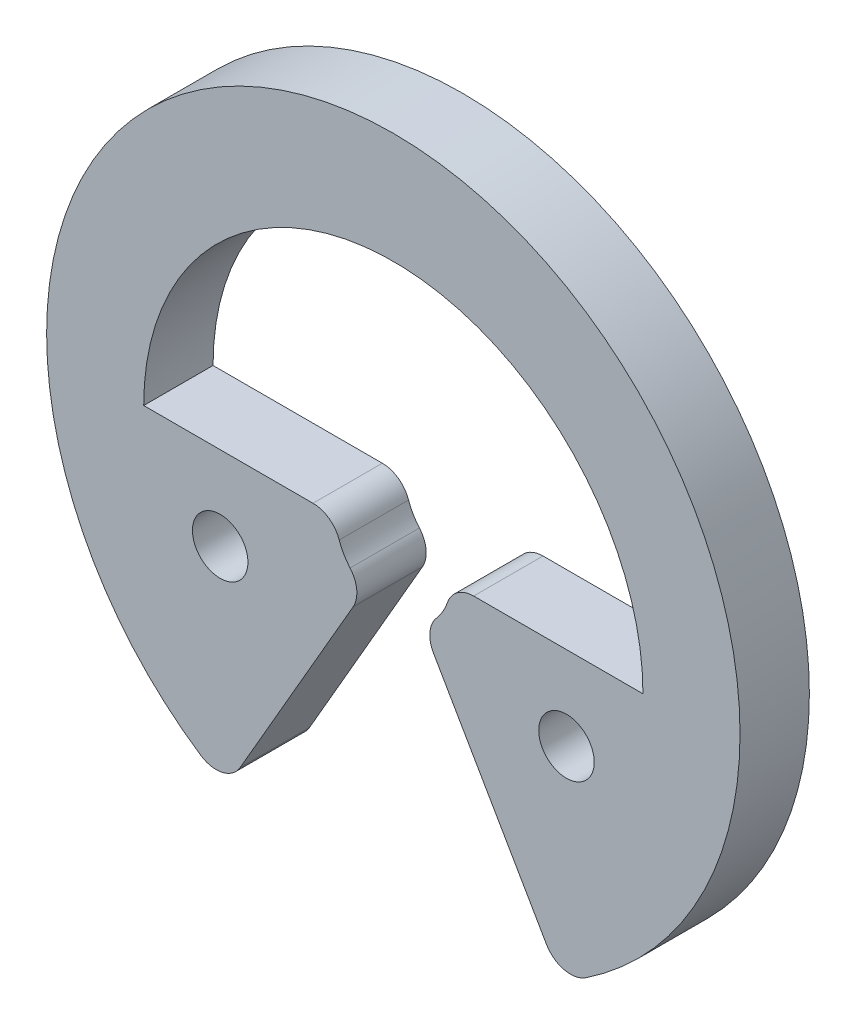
ISO-10303-21;
HEADER;
FILE_DESCRIPTION(('STEP AP214'),'2;1');
FILE_NAME('part.step','',(''),(''),'','','');
FILE_SCHEMA(('AUTOMOTIVE_DESIGN { 1 0 10303 214 1 1 1 1 }'));
ENDSEC;
DATA;
#1=APPLICATION_CONTEXT('core data for automotive mechanical design processes');
#2=APPLICATION_PROTOCOL_DEFINITION('international standard','automotive_design',2000,#1);
#3=PRODUCT_CONTEXT('',#1,'mechanical');
#4=PRODUCT('Part','Part','',(#3));
#5=PRODUCT_RELATED_PRODUCT_CATEGORY('part','',(#4));
#6=PRODUCT_DEFINITION_FORMATION('','',#4);
#7=PRODUCT_DEFINITION_CONTEXT('part definition',#1,'design');
#8=PRODUCT_DEFINITION('design','',#6,#7);
#9=PRODUCT_DEFINITION_SHAPE('','',#8);
#10=(LENGTH_UNIT() NAMED_UNIT(*) SI_UNIT(.MILLI.,.METRE.));
#11=(NAMED_UNIT(*) PLANE_ANGLE_UNIT() SI_UNIT($,.RADIAN.));
#12=(NAMED_UNIT(*) SI_UNIT($,.STERADIAN.) SOLID_ANGLE_UNIT());
#13=UNCERTAINTY_MEASURE_WITH_UNIT(LENGTH_MEASURE(1.E-05),#10,'distance_accuracy_value','');
#14=(GEOMETRIC_REPRESENTATION_CONTEXT(3) GLOBAL_UNCERTAINTY_ASSIGNED_CONTEXT((#13)) GLOBAL_UNIT_ASSIGNED_CONTEXT((#10,
#11,#12)) REPRESENTATION_CONTEXT('',''));
#15=CARTESIAN_POINT('',(0.,0.,0.));
#16=DIRECTION('',(0.,0.,1.));
#17=DIRECTION('',(1.,0.,0.));
#18=AXIS2_PLACEMENT_3D('',#15,#16,#17);
#19=CARTESIAN_POINT('',(0.579347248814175,-0.199999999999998,0.5));
#20=DIRECTION('',(0.,0.,-1.));
#21=DIRECTION('',(-1.,0.,0.));
#22=AXIS2_PLACEMENT_3D('',#19,#20,#21);
#23=PLANE('',#22);
#24=CARTESIAN_POINT('',(-1.24848102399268,-0.603586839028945,0.5));
#25=DIRECTION('',(0.,0.,1.));
#26=DIRECTION('',(1.,0.,0.));
#27=AXIS2_PLACEMENT_3D('',#24,#25,#26);
#28=CIRCLE('',#27,0.2);
#29=CARTESIAN_POINT('',(-1.04848102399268,-0.603586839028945,0.5));
#30=VERTEX_POINT('',#29);
#31=EDGE_CURVE('E152',#30,#30,#28,.T.);
#32=ORIENTED_EDGE('',*,*,#31,.F.);
#33=EDGE_LOOP('',(#32));
#34=FACE_BOUND('',#33,.T.);
#35=CARTESIAN_POINT('',(0.579347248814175,-0.199999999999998,0.5));
#36=DIRECTION('',(0.,0.,1.));
#37=DIRECTION('',(-1.,0.,0.));
#38=AXIS2_PLACEMENT_3D('',#35,#36,#37);
#39=CIRCLE('',#38,0.2);
#40=CARTESIAN_POINT('',(0.579347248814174,0.,0.5));
#41=VERTEX_POINT('',#40);
#42=CARTESIAN_POINT('',(0.39029529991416,-0.134736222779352,0.5));
#43=VERTEX_POINT('',#42);
#44=EDGE_CURVE('E182',#41,#43,#39,.T.);
#45=ORIENTED_EDGE('',*,*,#44,.T.);
#46=CARTESIAN_POINT('',(0.,0.,0.5));
#47=DIRECTION('',(0.,0.,-1.));
#48=DIRECTION('',(1.,0.,0.));
#49=AXIS2_PLACEMENT_3D('',#46,#47,#48);
#50=CIRCLE('',#49,0.412897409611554);
#51=CARTESIAN_POINT('',(0.311832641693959,-0.270637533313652,0.5));
#52=VERTEX_POINT('',#51);
#53=EDGE_CURVE('E147',#43,#52,#50,.T.);
#54=ORIENTED_EDGE('',*,*,#53,.T.);
#55=CARTESIAN_POINT('',(0.462878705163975,-0.401729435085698,0.5));
#56=DIRECTION('',(0.,0.,1.));
#57=DIRECTION('',(-1.,0.,0.));
#58=AXIS2_PLACEMENT_3D('',#55,#56,#57);
#59=CIRCLE('',#58,0.2);
#60=CARTESIAN_POINT('',(0.289673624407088,-0.501729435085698,0.5));
#61=VERTEX_POINT('',#60);
#62=EDGE_CURVE('E185',#52,#61,#59,.T.);
#63=ORIENTED_EDGE('',*,*,#62,.T.);
#64=DIRECTION('',(0.500000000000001,-0.866025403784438,0.));
#65=VECTOR('',#64,1.);
#66=CARTESIAN_POINT('',(1.10425047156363,-1.91261792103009,0.5));
#67=LINE('',#66,#65);
#68=CARTESIAN_POINT('',(1.10425047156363,-1.91261792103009,0.5));
#69=VERTEX_POINT('',#68);
#70=EDGE_CURVE('E187',#61,#69,#67,.T.);
#71=ORIENTED_EDGE('',*,*,#70,.T.);
#72=CARTESIAN_POINT('',(1.27745555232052,-1.81261792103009,0.5));
#73=DIRECTION('',(0.,0.,1.));
#74=DIRECTION('',(-1.,0.,0.));
#75=AXIS2_PLACEMENT_3D('',#72,#73,#74);
#76=CIRCLE('',#75,0.2);
#77=CARTESIAN_POINT('',(1.38853864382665,-1.9789325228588,0.5));
#78=VERTEX_POINT('',#77);
#79=EDGE_CURVE('E189',#69,#78,#76,.T.);
#80=ORIENTED_EDGE('',*,*,#79,.T.);
#81=CARTESIAN_POINT('',(0.,0.1,0.5));
#82=DIRECTION('',(0.,0.,1.));
#83=DIRECTION('',(1.,0.,0.));
#84=AXIS2_PLACEMENT_3D('',#81,#82,#83);
#85=CIRCLE('',#84,2.5);
#86=CARTESIAN_POINT('',(-1.38853864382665,-1.9789325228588,0.5));
#87=VERTEX_POINT('',#86);
#88=EDGE_CURVE('E191',#78,#87,#85,.T.);
#89=ORIENTED_EDGE('',*,*,#88,.T.);
#90=CARTESIAN_POINT('',(-1.27745555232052,-1.81261792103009,0.5));
#91=DIRECTION('',(0.,0.,1.));
#92=DIRECTION('',(1.,0.,0.));
#93=AXIS2_PLACEMENT_3D('',#90,#91,#92);
#94=CIRCLE('',#93,0.2);
#95=CARTESIAN_POINT('',(-1.10425047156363,-1.91261792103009,0.5));
#96=VERTEX_POINT('',#95);
#97=EDGE_CURVE('E193',#87,#96,#94,.T.);
#98=ORIENTED_EDGE('',*,*,#97,.T.);
#99=DIRECTION('',(0.500000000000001,0.866025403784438,0.));
#100=VECTOR('',#99,1.);
#101=CARTESIAN_POINT('',(-1.10425047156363,-1.91261792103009,0.5));
#102=LINE('',#101,#100);
#103=CARTESIAN_POINT('',(-0.289673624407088,-0.501729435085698,0.5));
#104=VERTEX_POINT('',#103);
#105=EDGE_CURVE('E195',#96,#104,#102,.T.);
#106=ORIENTED_EDGE('',*,*,#105,.T.);
#107=CARTESIAN_POINT('',(-0.462878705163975,-0.401729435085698,0.5));
#108=DIRECTION('',(0.,0.,1.));
#109=DIRECTION('',(1.,0.,0.));
#110=AXIS2_PLACEMENT_3D('',#107,#108,#109);
#111=CIRCLE('',#110,0.2);
#112=CARTESIAN_POINT('',(-0.311832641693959,-0.270637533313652,0.5));
#113=VERTEX_POINT('',#112);
#114=EDGE_CURVE('E197',#104,#113,#111,.T.);
#115=ORIENTED_EDGE('',*,*,#114,.T.);
#116=CARTESIAN_POINT('',(0.,0.,0.5));
#117=DIRECTION('',(0.,0.,-1.));
#118=DIRECTION('',(1.,0.,0.));
#119=AXIS2_PLACEMENT_3D('',#116,#117,#118);
#120=CIRCLE('',#119,0.412897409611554);
#121=CARTESIAN_POINT('',(-0.39029529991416,-0.134736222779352,0.5));
#122=VERTEX_POINT('',#121);
#123=EDGE_CURVE('E199',#113,#122,#120,.T.);
#124=ORIENTED_EDGE('',*,*,#123,.T.);
#125=CARTESIAN_POINT('',(-0.579347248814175,-0.199999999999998,0.5));
#126=DIRECTION('',(0.,0.,1.));
#127=DIRECTION('',(-1.,0.,0.));
#128=AXIS2_PLACEMENT_3D('',#125,#126,#127);
#129=CIRCLE('',#128,0.2);
#130=CARTESIAN_POINT('',(-0.579347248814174,0.,0.5));
#131=VERTEX_POINT('',#130);
#132=EDGE_CURVE('E201',#122,#131,#129,.T.);
#133=ORIENTED_EDGE('',*,*,#132,.T.);
#134=DIRECTION('',(-1.,0.,0.));
#135=VECTOR('',#134,1.);
#136=CARTESIAN_POINT('',(-0.579347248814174,0.,0.5));
#137=LINE('',#136,#135);
#138=CARTESIAN_POINT('',(-1.8,0.,0.5));
#139=VERTEX_POINT('',#138);
#140=EDGE_CURVE('E203',#131,#139,#137,.T.);
#141=ORIENTED_EDGE('',*,*,#140,.T.);
#142=CARTESIAN_POINT('',(0.,0.,0.5));
#143=DIRECTION('',(0.,0.,-1.));
#144=DIRECTION('',(1.,0.,0.));
#145=AXIS2_PLACEMENT_3D('',#142,#143,#144);
#146=CIRCLE('',#145,1.8);
#147=CARTESIAN_POINT('',(1.8,0.,0.5));
#148=VERTEX_POINT('',#147);
#149=EDGE_CURVE('E52',#139,#148,#146,.T.);
#150=ORIENTED_EDGE('',*,*,#149,.T.);
#151=DIRECTION('',(-1.,0.,0.));
#152=VECTOR('',#151,1.);
#153=CARTESIAN_POINT('',(0.579347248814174,0.,0.5));
#154=LINE('',#153,#152);
#155=EDGE_CURVE('E47',#148,#41,#154,.T.);
#156=ORIENTED_EDGE('',*,*,#155,.T.);
#157=EDGE_LOOP('',(#45,#54,#63,#71,#80,#89,#98,#106,#115,#124,#133,#141,#150,#156));
#158=FACE_BOUND('',#157,.T.);
#159=CARTESIAN_POINT('',(1.24848102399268,-0.603586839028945,0.5));
#160=DIRECTION('',(0.,0.,1.));
#161=DIRECTION('',(-1.,0.,0.));
#162=AXIS2_PLACEMENT_3D('',#159,#160,#161);
#163=CIRCLE('',#162,0.2);
#164=CARTESIAN_POINT('',(1.04848102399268,-0.603586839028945,0.5));
#165=VERTEX_POINT('',#164);
#166=EDGE_CURVE('E322',#165,#165,#163,.T.);
#167=ORIENTED_EDGE('',*,*,#166,.F.);
#168=EDGE_LOOP('',(#167));
#169=FACE_BOUND('',#168,.T.);
#170=ADVANCED_FACE('F32',(#34,#158,#169),#23,.F.);
#171=CARTESIAN_POINT('',(0.579347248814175,-0.199999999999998,0.));
#172=DIRECTION('',(0.,0.,-1.));
#173=DIRECTION('',(-1.,0.,0.));
#174=AXIS2_PLACEMENT_3D('',#171,#172,#173);
#175=PLANE('',#174);
#176=CARTESIAN_POINT('',(-1.24848102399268,-0.603586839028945,0.));
#177=DIRECTION('',(0.,0.,1.));
#178=DIRECTION('',(1.,0.,0.));
#179=AXIS2_PLACEMENT_3D('',#176,#177,#178);
#180=CIRCLE('',#179,0.2);
#181=CARTESIAN_POINT('',(-1.04848102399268,-0.603586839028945,0.));
#182=VERTEX_POINT('',#181);
#183=EDGE_CURVE('E155',#182,#182,#180,.T.);
#184=ORIENTED_EDGE('',*,*,#183,.T.);
#185=EDGE_LOOP('',(#184));
#186=FACE_BOUND('',#185,.T.);
#187=CARTESIAN_POINT('',(0.579347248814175,-0.199999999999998,0.));
#188=DIRECTION('',(0.,0.,1.));
#189=DIRECTION('',(-1.,0.,0.));
#190=AXIS2_PLACEMENT_3D('',#187,#188,#189);
#191=CIRCLE('',#190,0.2);
#192=CARTESIAN_POINT('',(0.579347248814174,0.,0.));
#193=VERTEX_POINT('',#192);
#194=CARTESIAN_POINT('',(0.39029529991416,-0.134736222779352,0.));
#195=VERTEX_POINT('',#194);
#196=EDGE_CURVE('E138',#193,#195,#191,.T.);
#197=ORIENTED_EDGE('',*,*,#196,.F.);
#198=DIRECTION('',(-1.,0.,0.));
#199=VECTOR('',#198,1.);
#200=CARTESIAN_POINT('',(0.579347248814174,0.,0.));
#201=LINE('',#200,#199);
#202=CARTESIAN_POINT('',(1.8,0.,0.));
#203=VERTEX_POINT('',#202);
#204=EDGE_CURVE('E180',#203,#193,#201,.T.);
#205=ORIENTED_EDGE('',*,*,#204,.F.);
#206=CARTESIAN_POINT('',(0.,0.,0.));
#207=DIRECTION('',(0.,0.,-1.));
#208=DIRECTION('',(1.,0.,0.));
#209=AXIS2_PLACEMENT_3D('',#206,#207,#208);
#210=CIRCLE('',#209,1.8);
#211=CARTESIAN_POINT('',(-1.8,0.,0.));
#212=VERTEX_POINT('',#211);
#213=EDGE_CURVE('E178',#212,#203,#210,.T.);
#214=ORIENTED_EDGE('',*,*,#213,.F.);
#215=DIRECTION('',(-1.,0.,0.));
#216=VECTOR('',#215,1.);
#217=CARTESIAN_POINT('',(-0.579347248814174,0.,0.));
#218=LINE('',#217,#216);
#219=CARTESIAN_POINT('',(-0.579347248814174,0.,0.));
#220=VERTEX_POINT('',#219);
#221=EDGE_CURVE('E176',#220,#212,#218,.T.);
#222=ORIENTED_EDGE('',*,*,#221,.F.);
#223=CARTESIAN_POINT('',(-0.579347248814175,-0.199999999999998,0.));
#224=DIRECTION('',(0.,0.,1.));
#225=DIRECTION('',(-1.,0.,0.));
#226=AXIS2_PLACEMENT_3D('',#223,#224,#225);
#227=CIRCLE('',#226,0.2);
#228=CARTESIAN_POINT('',(-0.39029529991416,-0.134736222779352,0.));
#229=VERTEX_POINT('',#228);
#230=EDGE_CURVE('E174',#229,#220,#227,.T.);
#231=ORIENTED_EDGE('',*,*,#230,.F.);
#232=CARTESIAN_POINT('',(0.,0.,0.));
#233=DIRECTION('',(0.,0.,-1.));
#234=DIRECTION('',(1.,0.,0.));
#235=AXIS2_PLACEMENT_3D('',#232,#233,#234);
#236=CIRCLE('',#235,0.412897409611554);
#237=CARTESIAN_POINT('',(-0.311832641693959,-0.270637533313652,0.));
#238=VERTEX_POINT('',#237);
#239=EDGE_CURVE('E172',#238,#229,#236,.T.);
#240=ORIENTED_EDGE('',*,*,#239,.F.);
#241=CARTESIAN_POINT('',(-0.462878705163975,-0.401729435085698,0.));
#242=DIRECTION('',(0.,0.,1.));
#243=DIRECTION('',(1.,0.,0.));
#244=AXIS2_PLACEMENT_3D('',#241,#242,#243);
#245=CIRCLE('',#244,0.2);
#246=CARTESIAN_POINT('',(-0.289673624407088,-0.501729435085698,0.));
#247=VERTEX_POINT('',#246);
#248=EDGE_CURVE('E170',#247,#238,#245,.T.);
#249=ORIENTED_EDGE('',*,*,#248,.F.);
#250=DIRECTION('',(0.500000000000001,0.866025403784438,0.));
#251=VECTOR('',#250,1.);
#252=CARTESIAN_POINT('',(-1.10425047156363,-1.91261792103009,0.));
#253=LINE('',#252,#251);
#254=CARTESIAN_POINT('',(-1.10425047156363,-1.91261792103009,0.));
#255=VERTEX_POINT('',#254);
#256=EDGE_CURVE('E168',#255,#247,#253,.T.);
#257=ORIENTED_EDGE('',*,*,#256,.F.);
#258=CARTESIAN_POINT('',(-1.27745555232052,-1.81261792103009,0.));
#259=DIRECTION('',(0.,0.,1.));
#260=DIRECTION('',(1.,0.,0.));
#261=AXIS2_PLACEMENT_3D('',#258,#259,#260);
#262=CIRCLE('',#261,0.2);
#263=CARTESIAN_POINT('',(-1.38853864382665,-1.9789325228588,0.));
#264=VERTEX_POINT('',#263);
#265=EDGE_CURVE('E166',#264,#255,#262,.T.);
#266=ORIENTED_EDGE('',*,*,#265,.F.);
#267=CARTESIAN_POINT('',(0.,0.1,0.));
#268=DIRECTION('',(0.,0.,1.));
#269=DIRECTION('',(1.,0.,0.));
#270=AXIS2_PLACEMENT_3D('',#267,#268,#269);
#271=CIRCLE('',#270,2.5);
#272=CARTESIAN_POINT('',(1.38853864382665,-1.9789325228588,0.));
#273=VERTEX_POINT('',#272);
#274=EDGE_CURVE('E164',#273,#264,#271,.T.);
#275=ORIENTED_EDGE('',*,*,#274,.F.);
#276=CARTESIAN_POINT('',(1.27745555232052,-1.81261792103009,0.));
#277=DIRECTION('',(0.,0.,1.));
#278=DIRECTION('',(-1.,0.,0.));
#279=AXIS2_PLACEMENT_3D('',#276,#277,#278);
#280=CIRCLE('',#279,0.2);
#281=CARTESIAN_POINT('',(1.10425047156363,-1.91261792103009,0.));
#282=VERTEX_POINT('',#281);
#283=EDGE_CURVE('E162',#282,#273,#280,.T.);
#284=ORIENTED_EDGE('',*,*,#283,.F.);
#285=DIRECTION('',(0.500000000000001,-0.866025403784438,0.));
#286=VECTOR('',#285,1.);
#287=CARTESIAN_POINT('',(1.10425047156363,-1.91261792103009,0.));
#288=LINE('',#287,#286);
#289=CARTESIAN_POINT('',(0.289673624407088,-0.501729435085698,0.));
#290=VERTEX_POINT('',#289);
#291=EDGE_CURVE('E160',#290,#282,#288,.T.);
#292=ORIENTED_EDGE('',*,*,#291,.F.);
#293=CARTESIAN_POINT('',(0.462878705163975,-0.401729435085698,0.));
#294=DIRECTION('',(0.,0.,1.));
#295=DIRECTION('',(-1.,0.,0.));
#296=AXIS2_PLACEMENT_3D('',#293,#294,#295);
#297=CIRCLE('',#296,0.2);
#298=CARTESIAN_POINT('',(0.311832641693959,-0.270637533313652,0.));
#299=VERTEX_POINT('',#298);
#300=EDGE_CURVE('E140',#299,#290,#297,.T.);
#301=ORIENTED_EDGE('',*,*,#300,.F.);
#302=CARTESIAN_POINT('',(0.,0.,0.));
#303=DIRECTION('',(0.,0.,-1.));
#304=DIRECTION('',(1.,0.,0.));
#305=AXIS2_PLACEMENT_3D('',#302,#303,#304);
#306=CIRCLE('',#305,0.412897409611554);
#307=EDGE_CURVE('E133',#195,#299,#306,.T.);
#308=ORIENTED_EDGE('',*,*,#307,.F.);
#309=EDGE_LOOP('',(#197,#205,#214,#222,#231,#240,#249,#257,#266,#275,#284,#292,#301,#308));
#310=FACE_BOUND('',#309,.T.);
#311=CARTESIAN_POINT('',(1.24848102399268,-0.603586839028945,0.));
#312=DIRECTION('',(0.,0.,1.));
#313=DIRECTION('',(-1.,0.,0.));
#314=AXIS2_PLACEMENT_3D('',#311,#312,#313);
#315=CIRCLE('',#314,0.2);
#316=CARTESIAN_POINT('',(1.04848102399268,-0.603586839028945,0.));
#317=VERTEX_POINT('',#316);
#318=EDGE_CURVE('E325',#317,#317,#315,.T.);
#319=ORIENTED_EDGE('',*,*,#318,.T.);
#320=EDGE_LOOP('',(#319));
#321=FACE_BOUND('',#320,.T.);
#322=ADVANCED_FACE('F134',(#186,#310,#321),#175,.T.);
#323=CARTESIAN_POINT('',(0.579347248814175,-0.199999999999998,0.5));
#324=DIRECTION('',(0.,0.,-1.));
#325=DIRECTION('',(-1.,0.,0.));
#326=AXIS2_PLACEMENT_3D('',#323,#324,#325);
#327=CYLINDRICAL_SURFACE('',#326,0.2);
#328=ORIENTED_EDGE('',*,*,#196,.T.);
#329=DIRECTION('',(0.,0.,-1.));
#330=VECTOR('',#329,1.);
#331=CARTESIAN_POINT('',(0.39029529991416,-0.134736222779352,0.5));
#332=LINE('',#331,#330);
#333=EDGE_CURVE('E11',#43,#195,#332,.T.);
#334=ORIENTED_EDGE('',*,*,#333,.F.);
#335=ORIENTED_EDGE('',*,*,#44,.F.);
#336=DIRECTION('',(0.,0.,-1.));
#337=VECTOR('',#336,1.);
#338=CARTESIAN_POINT('',(0.579347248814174,0.,0.5));
#339=LINE('',#338,#337);
#340=EDGE_CURVE('E151',#41,#193,#339,.T.);
#341=ORIENTED_EDGE('',*,*,#340,.T.);
#342=EDGE_LOOP('',(#328,#334,#335,#341));
#343=FACE_BOUND('',#342,.T.);
#344=ADVANCED_FACE('F34',(#343),#327,.T.);
#345=CARTESIAN_POINT('',(0.,0.,0.5));
#346=DIRECTION('',(0.,0.,-1.));
#347=DIRECTION('',(-1.,0.,0.));
#348=AXIS2_PLACEMENT_3D('',#345,#346,#347);
#349=CYLINDRICAL_SURFACE('',#348,0.412897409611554);
#350=ORIENTED_EDGE('',*,*,#307,.T.);
#351=DIRECTION('',(0.,0.,-1.));
#352=VECTOR('',#351,1.);
#353=CARTESIAN_POINT('',(0.311832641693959,-0.270637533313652,0.5));
#354=LINE('',#353,#352);
#355=EDGE_CURVE('E40',#52,#299,#354,.T.);
#356=ORIENTED_EDGE('',*,*,#355,.F.);
#357=ORIENTED_EDGE('',*,*,#53,.F.);
#358=ORIENTED_EDGE('',*,*,#333,.T.);
#359=EDGE_LOOP('',(#350,#356,#357,#358));
#360=FACE_BOUND('',#359,.T.);
#361=ADVANCED_FACE('F146',(#360),#349,.F.);
#362=CARTESIAN_POINT('',(0.462878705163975,-0.401729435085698,0.5));
#363=DIRECTION('',(0.,0.,-1.));
#364=DIRECTION('',(-1.,0.,0.));
#365=AXIS2_PLACEMENT_3D('',#362,#363,#364);
#366=CYLINDRICAL_SURFACE('',#365,0.2);
#367=ORIENTED_EDGE('',*,*,#300,.T.);
#368=DIRECTION('',(0.,0.,-1.));
#369=VECTOR('',#368,1.);
#370=CARTESIAN_POINT('',(0.289673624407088,-0.501729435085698,0.5));
#371=LINE('',#370,#369);
#372=EDGE_CURVE('E238',#61,#290,#371,.T.);
#373=ORIENTED_EDGE('',*,*,#372,.F.);
#374=ORIENTED_EDGE('',*,*,#62,.F.);
#375=ORIENTED_EDGE('',*,*,#355,.T.);
#376=EDGE_LOOP('',(#367,#373,#374,#375));
#377=FACE_BOUND('',#376,.T.);
#378=ADVANCED_FACE('F242',(#377),#366,.T.);
#379=CARTESIAN_POINT('',(1.10425047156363,-1.91261792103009,0.5));
#380=DIRECTION('',(0.866025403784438,0.500000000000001,0.));
#381=DIRECTION('',(-0.500000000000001,0.866025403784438,0.));
#382=AXIS2_PLACEMENT_3D('',#379,#380,#381);
#383=PLANE('',#382);
#384=ORIENTED_EDGE('',*,*,#291,.T.);
#385=DIRECTION('',(0.,0.,-1.));
#386=VECTOR('',#385,1.);
#387=CARTESIAN_POINT('',(1.10425047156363,-1.91261792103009,0.5));
#388=LINE('',#387,#386);
#389=EDGE_CURVE('E235',#69,#282,#388,.T.);
#390=ORIENTED_EDGE('',*,*,#389,.F.);
#391=ORIENTED_EDGE('',*,*,#70,.F.);
#392=ORIENTED_EDGE('',*,*,#372,.T.);
#393=EDGE_LOOP('',(#384,#390,#391,#392));
#394=FACE_BOUND('',#393,.T.);
#395=ADVANCED_FACE('F250',(#394),#383,.F.);
#396=CARTESIAN_POINT('',(1.27745555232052,-1.81261792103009,0.5));
#397=DIRECTION('',(0.,0.,-1.));
#398=DIRECTION('',(-1.,0.,0.));
#399=AXIS2_PLACEMENT_3D('',#396,#397,#398);
#400=CYLINDRICAL_SURFACE('',#399,0.2);
#401=ORIENTED_EDGE('',*,*,#283,.T.);
#402=DIRECTION('',(0.,0.,-1.));
#403=VECTOR('',#402,1.);
#404=CARTESIAN_POINT('',(1.38853864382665,-1.9789325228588,0.5));
#405=LINE('',#404,#403);
#406=EDGE_CURVE('E232',#78,#273,#405,.T.);
#407=ORIENTED_EDGE('',*,*,#406,.F.);
#408=ORIENTED_EDGE('',*,*,#79,.F.);
#409=ORIENTED_EDGE('',*,*,#389,.T.);
#410=EDGE_LOOP('',(#401,#407,#408,#409));
#411=FACE_BOUND('',#410,.T.);
#412=ADVANCED_FACE('F253',(#411),#400,.T.);
#413=CARTESIAN_POINT('',(0.,0.1,0.5));
#414=DIRECTION('',(0.,0.,-1.));
#415=DIRECTION('',(-1.,0.,0.));
#416=AXIS2_PLACEMENT_3D('',#413,#414,#415);
#417=CYLINDRICAL_SURFACE('',#416,2.5);
#418=ORIENTED_EDGE('',*,*,#274,.T.);
#419=DIRECTION('',(0.,0.,-1.));
#420=VECTOR('',#419,1.);
#421=CARTESIAN_POINT('',(-1.38853864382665,-1.9789325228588,0.5));
#422=LINE('',#421,#420);
#423=EDGE_CURVE('E229',#87,#264,#422,.T.);
#424=ORIENTED_EDGE('',*,*,#423,.F.);
#425=ORIENTED_EDGE('',*,*,#88,.F.);
#426=ORIENTED_EDGE('',*,*,#406,.T.);
#427=EDGE_LOOP('',(#418,#424,#425,#426));
#428=FACE_BOUND('',#427,.T.);
#429=ADVANCED_FACE('F258',(#428),#417,.T.);
#430=CARTESIAN_POINT('',(-1.27745555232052,-1.81261792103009,0.5));
#431=DIRECTION('',(0.,0.,-1.));
#432=DIRECTION('',(-1.,0.,0.));
#433=AXIS2_PLACEMENT_3D('',#430,#431,#432);
#434=CYLINDRICAL_SURFACE('',#433,0.2);
#435=ORIENTED_EDGE('',*,*,#265,.T.);
#436=DIRECTION('',(0.,0.,-1.));
#437=VECTOR('',#436,1.);
#438=CARTESIAN_POINT('',(-1.10425047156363,-1.91261792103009,0.5));
#439=LINE('',#438,#437);
#440=EDGE_CURVE('E226',#96,#255,#439,.T.);
#441=ORIENTED_EDGE('',*,*,#440,.F.);
#442=ORIENTED_EDGE('',*,*,#97,.F.);
#443=ORIENTED_EDGE('',*,*,#423,.T.);
#444=EDGE_LOOP('',(#435,#441,#442,#443));
#445=FACE_BOUND('',#444,.T.);
#446=ADVANCED_FACE('F264',(#445),#434,.T.);
#447=CARTESIAN_POINT('',(-1.10425047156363,-1.91261792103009,0.5));
#448=DIRECTION('',(-0.866025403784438,0.500000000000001,0.));
#449=DIRECTION('',(-0.500000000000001,-0.866025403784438,0.));
#450=AXIS2_PLACEMENT_3D('',#447,#448,#449);
#451=PLANE('',#450);
#452=ORIENTED_EDGE('',*,*,#256,.T.);
#453=DIRECTION('',(0.,0.,-1.));
#454=VECTOR('',#453,1.);
#455=CARTESIAN_POINT('',(-0.289673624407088,-0.501729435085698,0.5));
#456=LINE('',#455,#454);
#457=EDGE_CURVE('E223',#104,#247,#456,.T.);
#458=ORIENTED_EDGE('',*,*,#457,.F.);
#459=ORIENTED_EDGE('',*,*,#105,.F.);
#460=ORIENTED_EDGE('',*,*,#440,.T.);
#461=EDGE_LOOP('',(#452,#458,#459,#460));
#462=FACE_BOUND('',#461,.T.);
#463=ADVANCED_FACE('F268',(#462),#451,.F.);
#464=CARTESIAN_POINT('',(-0.462878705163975,-0.401729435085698,0.5));
#465=DIRECTION('',(0.,0.,-1.));
#466=DIRECTION('',(-1.,0.,0.));
#467=AXIS2_PLACEMENT_3D('',#464,#465,#466);
#468=CYLINDRICAL_SURFACE('',#467,0.2);
#469=ORIENTED_EDGE('',*,*,#248,.T.);
#470=DIRECTION('',(0.,0.,-1.));
#471=VECTOR('',#470,1.);
#472=CARTESIAN_POINT('',(-0.311832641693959,-0.270637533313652,0.5));
#473=LINE('',#472,#471);
#474=EDGE_CURVE('E220',#113,#238,#473,.T.);
#475=ORIENTED_EDGE('',*,*,#474,.F.);
#476=ORIENTED_EDGE('',*,*,#114,.F.);
#477=ORIENTED_EDGE('',*,*,#457,.T.);
#478=EDGE_LOOP('',(#469,#475,#476,#477));
#479=FACE_BOUND('',#478,.T.);
#480=ADVANCED_FACE('F273',(#479),#468,.T.);
#481=CARTESIAN_POINT('',(0.,0.,0.5));
#482=DIRECTION('',(0.,0.,-1.));
#483=DIRECTION('',(-1.,0.,0.));
#484=AXIS2_PLACEMENT_3D('',#481,#482,#483);
#485=CYLINDRICAL_SURFACE('',#484,0.412897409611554);
#486=ORIENTED_EDGE('',*,*,#239,.T.);
#487=DIRECTION('',(0.,0.,-1.));
#488=VECTOR('',#487,1.);
#489=CARTESIAN_POINT('',(-0.39029529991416,-0.134736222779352,0.5));
#490=LINE('',#489,#488);
#491=EDGE_CURVE('E217',#122,#229,#490,.T.);
#492=ORIENTED_EDGE('',*,*,#491,.F.);
#493=ORIENTED_EDGE('',*,*,#123,.F.);
#494=ORIENTED_EDGE('',*,*,#474,.T.);
#495=EDGE_LOOP('',(#486,#492,#493,#494));
#496=FACE_BOUND('',#495,.T.);
#497=ADVANCED_FACE('F279',(#496),#485,.F.);
#498=CARTESIAN_POINT('',(-0.579347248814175,-0.199999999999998,0.5));
#499=DIRECTION('',(0.,0.,-1.));
#500=DIRECTION('',(-1.,0.,0.));
#501=AXIS2_PLACEMENT_3D('',#498,#499,#500);
#502=CYLINDRICAL_SURFACE('',#501,0.2);
#503=ORIENTED_EDGE('',*,*,#230,.T.);
#504=DIRECTION('',(0.,0.,-1.));
#505=VECTOR('',#504,1.);
#506=CARTESIAN_POINT('',(-0.579347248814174,0.,0.5));
#507=LINE('',#506,#505);
#508=EDGE_CURVE('E214',#131,#220,#507,.T.);
#509=ORIENTED_EDGE('',*,*,#508,.F.);
#510=ORIENTED_EDGE('',*,*,#132,.F.);
#511=ORIENTED_EDGE('',*,*,#491,.T.);
#512=EDGE_LOOP('',(#503,#509,#510,#511));
#513=FACE_BOUND('',#512,.T.);
#514=ADVANCED_FACE('F283',(#513),#502,.T.);
#515=CARTESIAN_POINT('',(-0.579347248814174,0.,0.5));
#516=DIRECTION('',(0.,-1.,0.));
#517=DIRECTION('',(1.,0.,0.));
#518=AXIS2_PLACEMENT_3D('',#515,#516,#517);
#519=PLANE('',#518);
#520=ORIENTED_EDGE('',*,*,#221,.T.);
#521=DIRECTION('',(0.,0.,-1.));
#522=VECTOR('',#521,1.);
#523=CARTESIAN_POINT('',(-1.8,0.,0.5));
#524=LINE('',#523,#522);
#525=EDGE_CURVE('E211',#139,#212,#524,.T.);
#526=ORIENTED_EDGE('',*,*,#525,.F.);
#527=ORIENTED_EDGE('',*,*,#140,.F.);
#528=ORIENTED_EDGE('',*,*,#508,.T.);
#529=EDGE_LOOP('',(#520,#526,#527,#528));
#530=FACE_BOUND('',#529,.T.);
#531=ADVANCED_FACE('F288',(#530),#519,.F.);
#532=CARTESIAN_POINT('',(0.,0.,0.5));
#533=DIRECTION('',(0.,0.,-1.));
#534=DIRECTION('',(-1.,0.,0.));
#535=AXIS2_PLACEMENT_3D('',#532,#533,#534);
#536=CYLINDRICAL_SURFACE('',#535,1.8);
#537=ORIENTED_EDGE('',*,*,#213,.T.);
#538=DIRECTION('',(0.,0.,-1.));
#539=VECTOR('',#538,1.);
#540=CARTESIAN_POINT('',(1.8,0.,0.5));
#541=LINE('',#540,#539);
#542=EDGE_CURVE('E208',#148,#203,#541,.T.);
#543=ORIENTED_EDGE('',*,*,#542,.F.);
#544=ORIENTED_EDGE('',*,*,#149,.F.);
#545=ORIENTED_EDGE('',*,*,#525,.T.);
#546=EDGE_LOOP('',(#537,#543,#544,#545));
#547=FACE_BOUND('',#546,.T.);
#548=ADVANCED_FACE('F291',(#547),#536,.F.);
#549=CARTESIAN_POINT('',(0.579347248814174,0.,0.5));
#550=DIRECTION('',(0.,-1.,0.));
#551=DIRECTION('',(1.,0.,0.));
#552=AXIS2_PLACEMENT_3D('',#549,#550,#551);
#553=PLANE('',#552);
#554=ORIENTED_EDGE('',*,*,#204,.T.);
#555=ORIENTED_EDGE('',*,*,#340,.F.);
#556=ORIENTED_EDGE('',*,*,#155,.F.);
#557=ORIENTED_EDGE('',*,*,#542,.T.);
#558=EDGE_LOOP('',(#554,#555,#556,#557));
#559=FACE_BOUND('',#558,.T.);
#560=ADVANCED_FACE('F293',(#559),#553,.F.);
#561=CARTESIAN_POINT('',(-1.24848102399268,-0.603586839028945,0.5));
#562=DIRECTION('',(0.,0.,-1.));
#563=DIRECTION('',(-1.,0.,0.));
#564=AXIS2_PLACEMENT_3D('',#561,#562,#563);
#565=CYLINDRICAL_SURFACE('',#564,0.2);
#566=ORIENTED_EDGE('',*,*,#31,.T.);
#567=EDGE_LOOP('',(#566));
#568=FACE_BOUND('',#567,.T.);
#569=ORIENTED_EDGE('',*,*,#183,.F.);
#570=EDGE_LOOP('',(#569));
#571=FACE_BOUND('',#570,.T.);
#572=ADVANCED_FACE('F295',(#568,#571),#565,.F.);
#573=CARTESIAN_POINT('',(1.24848102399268,-0.603586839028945,0.5));
#574=DIRECTION('',(0.,0.,-1.));
#575=DIRECTION('',(-1.,0.,0.));
#576=AXIS2_PLACEMENT_3D('',#573,#574,#575);
#577=CYLINDRICAL_SURFACE('',#576,0.2);
#578=ORIENTED_EDGE('',*,*,#166,.T.);
#579=EDGE_LOOP('',(#578));
#580=FACE_BOUND('',#579,.T.);
#581=ORIENTED_EDGE('',*,*,#318,.F.);
#582=EDGE_LOOP('',(#581));
#583=FACE_BOUND('',#582,.T.);
#584=ADVANCED_FACE('F301',(#580,#583),#577,.F.);
#585=CLOSED_SHELL('',(#170,#322,#344,#361,#378,#395,#412,#429,#446,#463,#480,#497,#514,#531,
#548,#560,#572,#584));
#586=MANIFOLD_SOLID_BREP('B2',#585);
#587=ADVANCED_BREP_SHAPE_REPRESENTATION('',(#18,#586),#14);
#588=SHAPE_DEFINITION_REPRESENTATION(#9,#587);
ENDSEC;
END-ISO-10303-21;
